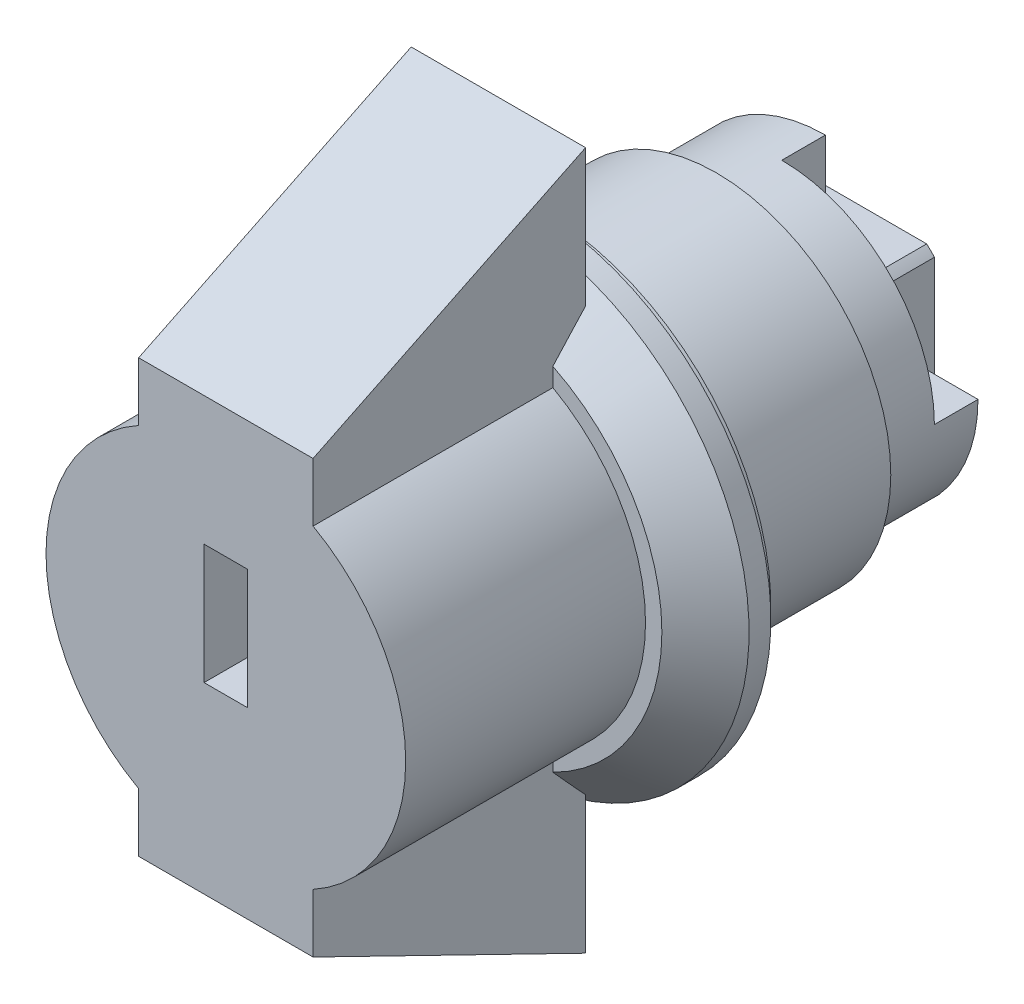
ISO-10303-21;
HEADER;
FILE_DESCRIPTION(('STEP AP214'),'2;1');
FILE_NAME('part.step','',(''),(''),'','','');
FILE_SCHEMA(('AUTOMOTIVE_DESIGN { 1 0 10303 214 1 1 1 1 }'));
ENDSEC;
DATA;
#1=APPLICATION_CONTEXT('core data for automotive mechanical design processes');
#2=APPLICATION_PROTOCOL_DEFINITION('international standard','automotive_design',2000,#1);
#3=PRODUCT_CONTEXT('',#1,'mechanical');
#4=PRODUCT('Part','Part','',(#3));
#5=PRODUCT_RELATED_PRODUCT_CATEGORY('part','',(#4));
#6=PRODUCT_DEFINITION_FORMATION('','',#4);
#7=PRODUCT_DEFINITION_CONTEXT('part definition',#1,'design');
#8=PRODUCT_DEFINITION('design','',#6,#7);
#9=PRODUCT_DEFINITION_SHAPE('','',#8);
#10=(LENGTH_UNIT() NAMED_UNIT(*) SI_UNIT(.MILLI.,.METRE.));
#11=(NAMED_UNIT(*) PLANE_ANGLE_UNIT() SI_UNIT($,.RADIAN.));
#12=(NAMED_UNIT(*) SI_UNIT($,.STERADIAN.) SOLID_ANGLE_UNIT());
#13=UNCERTAINTY_MEASURE_WITH_UNIT(LENGTH_MEASURE(1.E-05),#10,'distance_accuracy_value','');
#14=(GEOMETRIC_REPRESENTATION_CONTEXT(3) GLOBAL_UNCERTAINTY_ASSIGNED_CONTEXT((#13)) GLOBAL_UNIT_ASSIGNED_CONTEXT((#10,
#11,#12)) REPRESENTATION_CONTEXT('',''));
#15=CARTESIAN_POINT('',(0.,0.,0.));
#16=DIRECTION('',(0.,0.,1.));
#17=DIRECTION('',(1.,0.,0.));
#18=AXIS2_PLACEMENT_3D('',#15,#16,#17);
#19=CARTESIAN_POINT('',(0.,9.,3.5));
#20=DIRECTION('',(0.,0.,1.));
#21=DIRECTION('',(1.,0.,0.));
#22=AXIS2_PLACEMENT_3D('',#19,#20,#21);
#23=PLANE('',#22);
#24=CARTESIAN_POINT('',(0.,0.,3.5));
#25=DIRECTION('',(0.,0.,-1.));
#26=DIRECTION('',(-1.,0.,0.));
#27=AXIS2_PLACEMENT_3D('',#24,#25,#26);
#28=CIRCLE('',#27,9.);
#29=CARTESIAN_POINT('',(-4.,-8.06225774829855,3.5));
#30=VERTEX_POINT('',#29);
#31=CARTESIAN_POINT('',(-4.,8.06225774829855,3.5));
#32=VERTEX_POINT('',#31);
#33=EDGE_CURVE('E426',#30,#32,#28,.T.);
#34=ORIENTED_EDGE('',*,*,#33,.F.);
#35=DIRECTION('',(0.,1.,0.));
#36=VECTOR('',#35,1.);
#37=CARTESIAN_POINT('',(-4.,9.,3.5));
#38=LINE('',#37,#36);
#39=CARTESIAN_POINT('',(-4.,-7.21543484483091,3.5));
#40=VERTEX_POINT('',#39);
#41=EDGE_CURVE('E321',#30,#40,#38,.T.);
#42=ORIENTED_EDGE('',*,*,#41,.T.);
#43=CARTESIAN_POINT('',(0.,0.,3.5));
#44=DIRECTION('',(0.,0.,1.));
#45=DIRECTION('',(1.,0.,0.));
#46=AXIS2_PLACEMENT_3D('',#43,#44,#45);
#47=CIRCLE('',#46,8.25);
#48=CARTESIAN_POINT('',(-4.,7.21543484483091,3.5));
#49=VERTEX_POINT('',#48);
#50=EDGE_CURVE('E341',#49,#40,#47,.T.);
#51=ORIENTED_EDGE('',*,*,#50,.F.);
#52=EDGE_CURVE('E317',#49,#32,#38,.T.);
#53=ORIENTED_EDGE('',*,*,#52,.T.);
#54=EDGE_LOOP('',(#34,#42,#51,#53));
#55=FACE_BOUND('',#54,.T.);
#56=ADVANCED_FACE('F14',(#55),#23,.T.);
#57=CARTESIAN_POINT('',(0.,0.,1.5));
#58=DIRECTION('',(0.,0.,-1.));
#59=DIRECTION('',(-1.,0.,0.));
#60=AXIS2_PLACEMENT_3D('',#57,#58,#59);
#61=CONICAL_SURFACE('',#60,11.,0.785398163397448);
#62=CARTESIAN_POINT('',(0.,0.,1.5));
#63=DIRECTION('',(0.,0.,-1.));
#64=DIRECTION('',(-1.,0.,0.));
#65=AXIS2_PLACEMENT_3D('',#62,#63,#64);
#66=CIRCLE('',#65,11.);
#67=CARTESIAN_POINT('',(-11.,0.,1.5));
#68=VERTEX_POINT('',#67);
#69=EDGE_CURVE('E423',#68,#68,#66,.T.);
#70=ORIENTED_EDGE('',*,*,#69,.F.);
#71=EDGE_LOOP('',(#70));
#72=FACE_BOUND('',#71,.T.);
#73=CARTESIAN_POINT('',(0.,0.,2.));
#74=DIRECTION('',(0.,0.,1.));
#75=DIRECTION('',(1.,0.,0.));
#76=AXIS2_PLACEMENT_3D('',#73,#74,#75);
#77=CIRCLE('',#76,10.5);
#78=CARTESIAN_POINT('',(4.,-9.70824391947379,2.));
#79=VERTEX_POINT('',#78);
#80=CARTESIAN_POINT('',(-4.,-9.70824391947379,2.));
#81=VERTEX_POINT('',#80);
#82=EDGE_CURVE('E9',#79,#81,#77,.F.);
#83=ORIENTED_EDGE('',*,*,#82,.T.);
#84=CARTESIAN_POINT('',(-4.,-17.858105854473,-5.80059957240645));
#85=CARTESIAN_POINT('',(-4.,-17.5045819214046,-5.45563303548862));
#86=CARTESIAN_POINT('',(-4.,-17.1508222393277,-5.11090767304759));
#87=CARTESIAN_POINT('',(-4.,-16.4427152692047,-4.42205863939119));
#88=CARTESIAN_POINT('',(-4.,-16.0883679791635,-4.07793497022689));
#89=CARTESIAN_POINT('',(-4.,-15.3789386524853,-3.39037860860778));
#90=CARTESIAN_POINT('',(-4.,-15.0238565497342,-3.04694598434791));
#91=CARTESIAN_POINT('',(-4.,-14.3128340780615,-2.36097102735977));
#92=CARTESIAN_POINT('',(-4.,-13.9568937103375,-2.01842869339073));
#93=CARTESIAN_POINT('',(-4.,-13.2441762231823,-1.33467000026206));
#94=CARTESIAN_POINT('',(-4.,-12.8873997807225,-0.993452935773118));
#95=CARTESIAN_POINT('',(-4.,-12.1725099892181,-0.312422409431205));
#96=CARTESIAN_POINT('',(-4.,-11.8143966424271,0.0273910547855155));
#97=CARTESIAN_POINT('',(-4.,-11.0964623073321,0.705193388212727));
#98=CARTESIAN_POINT('',(-4.,-10.7366413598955,1.04318230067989));
#99=CARTESIAN_POINT('',(-4.,-10.0147552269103,1.71675339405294));
#100=CARTESIAN_POINT('',(-4.,-9.65269005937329,2.05233559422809));
#101=CARTESIAN_POINT('',(-4.,-9.01353072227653,2.63937643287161));
#102=CARTESIAN_POINT('',(-4.,-8.73708131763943,2.89153667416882));
#103=CARTESIAN_POINT('',(-4.,-8.18196173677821,3.393388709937));
#104=CARTESIAN_POINT('',(-4.,-7.90329163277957,3.64308058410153));
#105=CARTESIAN_POINT('',(-4.,-7.48306908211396,4.01518340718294));
#106=CARTESIAN_POINT('',(-4.,-7.34260789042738,4.13882693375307));
#107=CARTESIAN_POINT('',(-4.,-7.06084268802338,4.38514840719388));
#108=CARTESIAN_POINT('',(-4.,-6.91953868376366,4.50782636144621));
#109=CARTESIAN_POINT('',(-4.,-6.63594093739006,4.75206475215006));
#110=CARTESIAN_POINT('',(-4.,-6.49364709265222,4.87362506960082));
#111=CARTESIAN_POINT('',(-4.,-6.20790981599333,5.11539401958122));
#112=CARTESIAN_POINT('',(-4.,-6.06446635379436,5.23560261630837));
#113=CARTESIAN_POINT('',(-4.,-5.92036455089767,5.3550215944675));
#114=B_SPLINE_CURVE_WITH_KNOTS('',3,(#84,#85,#86,#87,#88,#89,#90,#91,#92,#93,#94,#95,#96,#97,
#98,#99,#100,#101,#102,#103,#104,#105,#106,#107,#108,#109,#110,#111,#112,#113),.UNSPECIFIED.,
.F.,.F.,(4,2,2,2,2,2,2,2,2,2,2,2,2,2,4),(0.,1.48183356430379,2.96367217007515,4.4456504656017,
5.92762669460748,7.4086594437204,8.88968969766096,10.3706846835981,11.8516677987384,
12.9741912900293,14.096678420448,14.65806033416,15.2194379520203,15.7808746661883,
16.342326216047),.UNSPECIFIED.);
#115=EDGE_CURVE('E330',#81,#30,#114,.T.);
#116=ORIENTED_EDGE('',*,*,#115,.T.);
#117=ORIENTED_EDGE('',*,*,#33,.T.);
#118=CARTESIAN_POINT('',(-4.,4.95832906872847,6.12936210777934));
#119=CARTESIAN_POINT('',(-4.,5.0787522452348,6.03562448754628));
#120=CARTESIAN_POINT('',(-4.,5.19853087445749,5.94106574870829));
#121=CARTESIAN_POINT('',(-4.,5.4369516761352,5.75053505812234));
#122=CARTESIAN_POINT('',(-4.,5.55559389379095,5.65456316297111));
#123=CARTESIAN_POINT('',(-4.,5.91001886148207,5.36489288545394));
#124=CARTESIAN_POINT('',(-4.,6.1443409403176,5.16940774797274));
#125=CARTESIAN_POINT('',(-4.,6.60990240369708,4.77500447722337));
#126=CARTESIAN_POINT('',(-4.,6.84114299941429,4.57608776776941));
#127=CARTESIAN_POINT('',(-4.,7.30130144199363,4.17556663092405));
#128=CARTESIAN_POINT('',(-4.,7.53021917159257,3.97396206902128));
#129=CARTESIAN_POINT('',(-4.,8.07664549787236,3.48829360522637));
#130=CARTESIAN_POINT('',(-4.,8.39327574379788,3.20324257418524));
#131=CARTESIAN_POINT('',(-4.,9.02386780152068,2.63020089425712));
#132=CARTESIAN_POINT('',(-4.,9.33782956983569,2.34221019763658));
#133=CARTESIAN_POINT('',(-4.,9.96372975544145,1.76400621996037));
#134=CARTESIAN_POINT('',(-4.,10.2756680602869,1.47379281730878));
#135=CARTESIAN_POINT('',(-4.,10.8979564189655,0.891667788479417));
#136=CARTESIAN_POINT('',(-4.,11.2083064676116,0.599756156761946));
#137=CARTESIAN_POINT('',(-4.,11.8281093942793,0.014254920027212));
#138=CARTESIAN_POINT('',(-4.,12.137560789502,-0.27933625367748));
#139=CARTESIAN_POINT('',(-4.,12.7554449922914,-0.867589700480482));
#140=CARTESIAN_POINT('',(-4.,13.0638777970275,-1.16225197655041));
#141=CARTESIAN_POINT('',(-4.,13.6798518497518,-1.75238711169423));
#142=CARTESIAN_POINT('',(-4.,13.9873932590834,-2.04785980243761));
#143=CARTESIAN_POINT('',(-4.,14.6017794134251,-2.63952462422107));
#144=CARTESIAN_POINT('',(-4.,14.9086241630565,-2.93571675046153));
#145=CARTESIAN_POINT('',(-4.,15.2151900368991,-3.23219653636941));
#146=B_SPLINE_CURVE_WITH_KNOTS('',3,(#118,#119,#120,#121,#122,#123,#124,#125,#126,#127,#128,
#129,#130,#131,#132,#133,#134,#135,#136,#137,#138,#139,#140,#141,#142,#143,#144,#145),
.UNSPECIFIED.,.F.,.F.,(4,2,2,2,2,2,2,2,2,2,2,2,2,4),(0.,0.457806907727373,0.915595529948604,
1.83101644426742,2.74606625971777,3.66116204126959,4.93925035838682,6.21735946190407,
7.49553899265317,8.77372269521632,10.0534083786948,11.3330976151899,12.6125386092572,
13.8919710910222),.UNSPECIFIED.);
#147=CARTESIAN_POINT('',(-4.,9.70824391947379,2.));
#148=VERTEX_POINT('',#147);
#149=EDGE_CURVE('E320',#32,#148,#146,.T.);
#150=ORIENTED_EDGE('',*,*,#149,.T.);
#151=CARTESIAN_POINT('',(4.,9.70824391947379,2.));
#152=VERTEX_POINT('',#151);
#153=EDGE_CURVE('E18',#148,#152,#77,.F.);
#154=ORIENTED_EDGE('',*,*,#153,.T.);
#155=CARTESIAN_POINT('',(4.,4.95832906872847,6.12936210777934));
#156=CARTESIAN_POINT('',(4.,5.0787522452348,6.03562448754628));
#157=CARTESIAN_POINT('',(4.,5.19853087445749,5.94106574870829));
#158=CARTESIAN_POINT('',(4.,5.4369516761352,5.75053505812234));
#159=CARTESIAN_POINT('',(4.,5.55559389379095,5.65456316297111));
#160=CARTESIAN_POINT('',(4.,5.91001886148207,5.36489288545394));
#161=CARTESIAN_POINT('',(4.,6.1443409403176,5.16940774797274));
#162=CARTESIAN_POINT('',(4.,6.60990240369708,4.77500447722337));
#163=CARTESIAN_POINT('',(4.,6.84114299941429,4.57608776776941));
#164=CARTESIAN_POINT('',(4.,7.30130144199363,4.17556663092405));
#165=CARTESIAN_POINT('',(4.,7.53021917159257,3.97396206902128));
#166=CARTESIAN_POINT('',(4.,8.07664549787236,3.48829360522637));
#167=CARTESIAN_POINT('',(4.,8.39327574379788,3.20324257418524));
#168=CARTESIAN_POINT('',(4.,9.02386780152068,2.63020089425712));
#169=CARTESIAN_POINT('',(4.,9.33782956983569,2.34221019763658));
#170=CARTESIAN_POINT('',(4.,9.96372975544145,1.76400621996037));
#171=CARTESIAN_POINT('',(4.,10.2756680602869,1.47379281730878));
#172=CARTESIAN_POINT('',(4.,10.8979564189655,0.891667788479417));
#173=CARTESIAN_POINT('',(4.,11.2083064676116,0.599756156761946));
#174=CARTESIAN_POINT('',(4.,11.8281093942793,0.014254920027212));
#175=CARTESIAN_POINT('',(4.,12.137560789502,-0.27933625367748));
#176=CARTESIAN_POINT('',(4.,12.7554449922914,-0.867589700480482));
#177=CARTESIAN_POINT('',(4.,13.0638777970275,-1.16225197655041));
#178=CARTESIAN_POINT('',(4.,13.6798518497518,-1.75238711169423));
#179=CARTESIAN_POINT('',(4.,13.9873932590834,-2.04785980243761));
#180=CARTESIAN_POINT('',(4.,14.6017794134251,-2.63952462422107));
#181=CARTESIAN_POINT('',(4.,14.9086241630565,-2.93571675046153));
#182=CARTESIAN_POINT('',(4.,15.2151900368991,-3.23219653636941));
#183=B_SPLINE_CURVE_WITH_KNOTS('',3,(#155,#156,#157,#158,#159,#160,#161,#162,#163,#164,#165,
#166,#167,#168,#169,#170,#171,#172,#173,#174,#175,#176,#177,#178,#179,#180,#181,#182),
.UNSPECIFIED.,.F.,.F.,(4,2,2,2,2,2,2,2,2,2,2,2,2,4),(0.,0.457806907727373,0.915595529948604,
1.83101644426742,2.74606625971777,3.66116204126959,4.93925035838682,6.21735946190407,
7.49553899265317,8.77372269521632,10.0534083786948,11.3330976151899,12.6125386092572,
13.8919710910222),.UNSPECIFIED.);
#184=CARTESIAN_POINT('',(4.,8.06225774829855,3.5));
#185=VERTEX_POINT('',#184);
#186=EDGE_CURVE('E281',#185,#152,#183,.T.);
#187=ORIENTED_EDGE('',*,*,#186,.F.);
#188=CARTESIAN_POINT('',(4.,-8.06225774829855,3.5));
#189=VERTEX_POINT('',#188);
#190=EDGE_CURVE('E429',#185,#189,#28,.T.);
#191=ORIENTED_EDGE('',*,*,#190,.T.);
#192=CARTESIAN_POINT('',(4.,-17.858105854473,-5.80059957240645));
#193=CARTESIAN_POINT('',(4.,-17.5045819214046,-5.45563303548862));
#194=CARTESIAN_POINT('',(4.,-17.1508222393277,-5.11090767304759));
#195=CARTESIAN_POINT('',(4.,-16.4427152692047,-4.42205863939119));
#196=CARTESIAN_POINT('',(4.,-16.0883679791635,-4.07793497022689));
#197=CARTESIAN_POINT('',(4.,-15.3789386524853,-3.39037860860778));
#198=CARTESIAN_POINT('',(4.,-15.0238565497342,-3.04694598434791));
#199=CARTESIAN_POINT('',(4.,-14.3128340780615,-2.36097102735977));
#200=CARTESIAN_POINT('',(4.,-13.9568937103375,-2.01842869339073));
#201=CARTESIAN_POINT('',(4.,-13.2441762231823,-1.33467000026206));
#202=CARTESIAN_POINT('',(4.,-12.8873997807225,-0.993452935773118));
#203=CARTESIAN_POINT('',(4.,-12.1725099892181,-0.312422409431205));
#204=CARTESIAN_POINT('',(4.,-11.8143966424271,0.0273910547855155));
#205=CARTESIAN_POINT('',(4.,-11.0964623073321,0.705193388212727));
#206=CARTESIAN_POINT('',(4.,-10.7366413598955,1.04318230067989));
#207=CARTESIAN_POINT('',(4.,-10.0147552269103,1.71675339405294));
#208=CARTESIAN_POINT('',(4.,-9.65269005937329,2.05233559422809));
#209=CARTESIAN_POINT('',(4.,-9.01353072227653,2.63937643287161));
#210=CARTESIAN_POINT('',(4.,-8.73708131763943,2.89153667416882));
#211=CARTESIAN_POINT('',(4.,-8.18196173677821,3.393388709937));
#212=CARTESIAN_POINT('',(4.,-7.90329163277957,3.64308058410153));
#213=CARTESIAN_POINT('',(4.,-7.48306908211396,4.01518340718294));
#214=CARTESIAN_POINT('',(4.,-7.34260789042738,4.13882693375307));
#215=CARTESIAN_POINT('',(4.,-7.06084268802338,4.38514840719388));
#216=CARTESIAN_POINT('',(4.,-6.91953868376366,4.50782636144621));
#217=CARTESIAN_POINT('',(4.,-6.63594093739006,4.75206475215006));
#218=CARTESIAN_POINT('',(4.,-6.49364709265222,4.87362506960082));
#219=CARTESIAN_POINT('',(4.,-6.20790981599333,5.11539401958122));
#220=CARTESIAN_POINT('',(4.,-6.06446635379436,5.23560261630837));
#221=CARTESIAN_POINT('',(4.,-5.92036455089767,5.3550215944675));
#222=B_SPLINE_CURVE_WITH_KNOTS('',3,(#192,#193,#194,#195,#196,#197,#198,#199,#200,#201,#202,
#203,#204,#205,#206,#207,#208,#209,#210,#211,#212,#213,#214,#215,#216,#217,#218,#219,#220,#221),
.UNSPECIFIED.,.F.,.F.,(4,2,2,2,2,2,2,2,2,2,2,2,2,2,4),(0.,1.48183356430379,2.96367217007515,
4.4456504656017,5.92762669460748,7.4086594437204,8.88968969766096,10.3706846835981,
11.8516677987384,12.9741912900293,14.096678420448,14.65806033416,15.2194379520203,
15.7808746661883,16.342326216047),.UNSPECIFIED.);
#223=EDGE_CURVE('E309',#79,#189,#222,.T.);
#224=ORIENTED_EDGE('',*,*,#223,.F.);
#225=EDGE_LOOP('',(#83,#116,#117,#150,#154,#187,#191,#224));
#226=FACE_BOUND('',#225,.T.);
#227=ADVANCED_FACE('F291',(#72,#226),#61,.T.);
#228=CARTESIAN_POINT('',(0.,0.,14.5));
#229=DIRECTION('',(0.,0.,-1.));
#230=DIRECTION('',(-1.,0.,0.));
#231=AXIS2_PLACEMENT_3D('',#228,#229,#230);
#232=CYLINDRICAL_SURFACE('',#231,8.25);
#233=DIRECTION('',(0.,0.,-1.));
#234=VECTOR('',#233,1.);
#235=CARTESIAN_POINT('',(-4.,-7.21543484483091,14.5));
#236=LINE('',#235,#234);
#237=CARTESIAN_POINT('',(-4.,-7.21543484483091,14.5));
#238=VERTEX_POINT('',#237);
#239=EDGE_CURVE('E328',#238,#40,#236,.T.);
#240=ORIENTED_EDGE('',*,*,#239,.F.);
#241=CARTESIAN_POINT('',(0.,0.,14.5));
#242=DIRECTION('',(0.,0.,1.));
#243=DIRECTION('',(1.,0.,0.));
#244=AXIS2_PLACEMENT_3D('',#241,#242,#243);
#245=CIRCLE('',#244,8.25);
#246=CARTESIAN_POINT('',(-4.,7.21543484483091,14.5));
#247=VERTEX_POINT('',#246);
#248=EDGE_CURVE('E345',#247,#238,#245,.T.);
#249=ORIENTED_EDGE('',*,*,#248,.F.);
#250=DIRECTION('',(0.,0.,-1.));
#251=VECTOR('',#250,1.);
#252=CARTESIAN_POINT('',(-4.,7.21543484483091,14.5));
#253=LINE('',#252,#251);
#254=EDGE_CURVE('E315',#49,#247,#253,.F.);
#255=ORIENTED_EDGE('',*,*,#254,.F.);
#256=ORIENTED_EDGE('',*,*,#50,.T.);
#257=EDGE_LOOP('',(#240,#249,#255,#256));
#258=FACE_BOUND('',#257,.T.);
#259=ADVANCED_FACE('F487',(#258),#232,.T.);
#260=CARTESIAN_POINT('',(0.,0.,-50.));
#261=DIRECTION('',(0.,0.,-1.));
#262=DIRECTION('',(-1.,0.,0.));
#263=AXIS2_PLACEMENT_3D('',#260,#261,#262);
#264=CYLINDRICAL_SURFACE('',#263,4.);
#265=DIRECTION('',(0.,0.,-1.));
#266=VECTOR('',#265,1.);
#267=CARTESIAN_POINT('',(-2.64575131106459,-3.,-7.61483519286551));
#268=LINE('',#267,#266);
#269=CARTESIAN_POINT('',(-2.64575131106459,-3.,-13.));
#270=VERTEX_POINT('',#269);
#271=CARTESIAN_POINT('',(-2.64575131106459,-3.,-15.));
#272=VERTEX_POINT('',#271);
#273=EDGE_CURVE('E380',#270,#272,#268,.T.);
#274=ORIENTED_EDGE('',*,*,#273,.F.);
#275=CARTESIAN_POINT('',(0.,0.,-13.));
#276=DIRECTION('',(0.,0.,-1.));
#277=DIRECTION('',(-1.,0.,0.));
#278=AXIS2_PLACEMENT_3D('',#275,#276,#277);
#279=CIRCLE('',#278,4.);
#280=CARTESIAN_POINT('',(-3.,-2.6457513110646,-13.));
#281=VERTEX_POINT('',#280);
#282=EDGE_CURVE('E440',#270,#281,#279,.T.);
#283=ORIENTED_EDGE('',*,*,#282,.T.);
#284=DIRECTION('',(0.,0.,-1.));
#285=VECTOR('',#284,1.);
#286=CARTESIAN_POINT('',(-3.,-2.6457513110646,-7.61483519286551));
#287=LINE('',#286,#285);
#288=CARTESIAN_POINT('',(-3.,-2.6457513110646,-15.));
#289=VERTEX_POINT('',#288);
#290=EDGE_CURVE('E405',#281,#289,#287,.T.);
#291=ORIENTED_EDGE('',*,*,#290,.T.);
#292=CARTESIAN_POINT('',(0.,0.,-15.));
#293=DIRECTION('',(0.,0.,-1.));
#294=DIRECTION('',(-1.,0.,0.));
#295=AXIS2_PLACEMENT_3D('',#292,#293,#294);
#296=CIRCLE('',#295,4.);
#297=EDGE_CURVE('E434',#272,#289,#296,.T.);
#298=ORIENTED_EDGE('',*,*,#297,.F.);
#299=EDGE_LOOP('',(#274,#283,#291,#298));
#300=FACE_BOUND('',#299,.T.);
#301=ADVANCED_FACE('F500',(#300),#264,.T.);
#302=DIRECTION('',(0.,0.,-1.));
#303=VECTOR('',#302,1.);
#304=CARTESIAN_POINT('',(2.64575131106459,-3.,-7.61483519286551));
#305=LINE('',#304,#303);
#306=CARTESIAN_POINT('',(2.64575131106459,-3.,-13.));
#307=VERTEX_POINT('',#306);
#308=CARTESIAN_POINT('',(2.64575131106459,-3.,-15.));
#309=VERTEX_POINT('',#308);
#310=EDGE_CURVE('E385',#307,#309,#305,.T.);
#311=ORIENTED_EDGE('',*,*,#310,.T.);
#312=CARTESIAN_POINT('',(3.,-2.64575131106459,-15.));
#313=VERTEX_POINT('',#312);
#314=EDGE_CURVE('E430',#313,#309,#296,.T.);
#315=ORIENTED_EDGE('',*,*,#314,.F.);
#316=DIRECTION('',(0.,0.,-1.));
#317=VECTOR('',#316,1.);
#318=CARTESIAN_POINT('',(3.,-2.64575131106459,-7.61483519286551));
#319=LINE('',#318,#317);
#320=CARTESIAN_POINT('',(3.,-2.64575131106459,-13.));
#321=VERTEX_POINT('',#320);
#322=EDGE_CURVE('E410',#321,#313,#319,.T.);
#323=ORIENTED_EDGE('',*,*,#322,.F.);
#324=EDGE_CURVE('E436',#321,#307,#279,.T.);
#325=ORIENTED_EDGE('',*,*,#324,.T.);
#326=EDGE_LOOP('',(#311,#315,#323,#325));
#327=FACE_BOUND('',#326,.T.);
#328=ADVANCED_FACE('F495',(#327),#264,.T.);
#329=CARTESIAN_POINT('',(0.,4.,-15.));
#330=DIRECTION('',(0.,0.,1.));
#331=DIRECTION('',(1.,0.,0.));
#332=AXIS2_PLACEMENT_3D('',#329,#330,#331);
#333=PLANE('',#332);
#334=CARTESIAN_POINT('',(0.,0.,-15.));
#335=DIRECTION('',(0.,0.,-1.));
#336=DIRECTION('',(-1.,0.,0.));
#337=AXIS2_PLACEMENT_3D('',#334,#335,#336);
#338=CIRCLE('',#337,2.5);
#339=CARTESIAN_POINT('',(-2.5,0.,-15.));
#340=VERTEX_POINT('',#339);
#341=EDGE_CURVE('E374',#340,#340,#338,.T.);
#342=ORIENTED_EDGE('',*,*,#341,.F.);
#343=EDGE_LOOP('',(#342));
#344=FACE_BOUND('',#343,.T.);
#345=DIRECTION('',(-1.,0.,0.));
#346=VECTOR('',#345,1.);
#347=CARTESIAN_POINT('',(2.64575131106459,-3.,-15.));
#348=LINE('',#347,#346);
#349=EDGE_CURVE('E381',#309,#272,#348,.T.);
#350=ORIENTED_EDGE('',*,*,#349,.T.);
#351=ORIENTED_EDGE('',*,*,#297,.T.);
#352=DIRECTION('',(0.,-1.,0.));
#353=VECTOR('',#352,1.);
#354=CARTESIAN_POINT('',(-3.,2.64575131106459,-15.));
#355=LINE('',#354,#353);
#356=CARTESIAN_POINT('',(-3.,2.64575131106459,-15.));
#357=VERTEX_POINT('',#356);
#358=EDGE_CURVE('E399',#357,#289,#355,.T.);
#359=ORIENTED_EDGE('',*,*,#358,.F.);
#360=CARTESIAN_POINT('',(-2.64575131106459,3.,-15.));
#361=VERTEX_POINT('',#360);
#362=EDGE_CURVE('E435',#357,#361,#296,.T.);
#363=ORIENTED_EDGE('',*,*,#362,.T.);
#364=DIRECTION('',(-1.,0.,0.));
#365=VECTOR('',#364,1.);
#366=CARTESIAN_POINT('',(2.64575131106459,3.,-15.));
#367=LINE('',#366,#365);
#368=CARTESIAN_POINT('',(2.64575131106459,3.,-15.));
#369=VERTEX_POINT('',#368);
#370=EDGE_CURVE('E387',#369,#361,#367,.T.);
#371=ORIENTED_EDGE('',*,*,#370,.F.);
#372=CARTESIAN_POINT('',(3.,2.64575131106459,-15.));
#373=VERTEX_POINT('',#372);
#374=EDGE_CURVE('E853',#369,#373,#296,.T.);
#375=ORIENTED_EDGE('',*,*,#374,.T.);
#376=DIRECTION('',(0.,-1.,0.));
#377=VECTOR('',#376,1.);
#378=CARTESIAN_POINT('',(3.,2.64575131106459,-15.));
#379=LINE('',#378,#377);
#380=EDGE_CURVE('E411',#373,#313,#379,.T.);
#381=ORIENTED_EDGE('',*,*,#380,.T.);
#382=ORIENTED_EDGE('',*,*,#314,.T.);
#383=EDGE_LOOP('',(#350,#351,#359,#363,#371,#375,#381,#382));
#384=FACE_BOUND('',#383,.T.);
#385=ADVANCED_FACE('F491',(#344,#384),#333,.F.);
#386=CARTESIAN_POINT('',(-3.,2.64575131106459,-13.));
#387=VERTEX_POINT('',#386);
#388=CARTESIAN_POINT('',(-2.64575131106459,3.,-13.));
#389=VERTEX_POINT('',#388);
#390=EDGE_CURVE('E433',#387,#389,#279,.T.);
#391=ORIENTED_EDGE('',*,*,#390,.T.);
#392=DIRECTION('',(0.,0.,-1.));
#393=VECTOR('',#392,1.);
#394=CARTESIAN_POINT('',(-2.64575131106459,3.,-7.61483519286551));
#395=LINE('',#394,#393);
#396=EDGE_CURVE('E394',#389,#361,#395,.T.);
#397=ORIENTED_EDGE('',*,*,#396,.T.);
#398=ORIENTED_EDGE('',*,*,#362,.F.);
#399=DIRECTION('',(0.,0.,-1.));
#400=VECTOR('',#399,1.);
#401=CARTESIAN_POINT('',(-3.,2.64575131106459,-7.61483519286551));
#402=LINE('',#401,#400);
#403=EDGE_CURVE('E408',#387,#357,#402,.T.);
#404=ORIENTED_EDGE('',*,*,#403,.F.);
#405=EDGE_LOOP('',(#391,#397,#398,#404));
#406=FACE_BOUND('',#405,.T.);
#407=ADVANCED_FACE('F494',(#406),#264,.T.);
#408=ORIENTED_EDGE('',*,*,#374,.F.);
#409=DIRECTION('',(0.,0.,-1.));
#410=VECTOR('',#409,1.);
#411=CARTESIAN_POINT('',(2.64575131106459,3.,-7.61483519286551));
#412=LINE('',#411,#410);
#413=CARTESIAN_POINT('',(2.64575131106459,3.,-13.));
#414=VERTEX_POINT('',#413);
#415=EDGE_CURVE('E397',#414,#369,#412,.T.);
#416=ORIENTED_EDGE('',*,*,#415,.F.);
#417=CARTESIAN_POINT('',(0.,0.,-13.));
#418=DIRECTION('',(0.,0.,-1.));
#419=DIRECTION('',(-1.,0.,0.));
#420=AXIS2_PLACEMENT_3D('',#417,#418,#419);
#421=CIRCLE('',#420,4.);
#422=CARTESIAN_POINT('',(0.,4.,-13.));
#423=VERTEX_POINT('',#422);
#424=EDGE_CURVE('E350',#423,#414,#421,.T.);
#425=ORIENTED_EDGE('',*,*,#424,.F.);
#426=DIRECTION('',(0.,0.,-1.));
#427=VECTOR('',#426,1.);
#428=CARTESIAN_POINT('',(0.,4.,-11.));
#429=LINE('',#428,#427);
#430=CARTESIAN_POINT('',(0.,4.,-11.));
#431=VERTEX_POINT('',#430);
#432=EDGE_CURVE('E369',#431,#423,#429,.T.);
#433=ORIENTED_EDGE('',*,*,#432,.F.);
#434=CARTESIAN_POINT('',(0.,0.,-11.));
#435=DIRECTION('',(0.,0.,-1.));
#436=DIRECTION('',(-1.,0.,0.));
#437=AXIS2_PLACEMENT_3D('',#434,#435,#436);
#438=CIRCLE('',#437,4.);
#439=CARTESIAN_POINT('',(4.,0.,-11.));
#440=VERTEX_POINT('',#439);
#441=EDGE_CURVE('E359',#431,#440,#438,.T.);
#442=ORIENTED_EDGE('',*,*,#441,.T.);
#443=DIRECTION('',(0.,0.,-1.));
#444=VECTOR('',#443,1.);
#445=CARTESIAN_POINT('',(4.,0.,-11.));
#446=LINE('',#445,#444);
#447=CARTESIAN_POINT('',(4.,0.,-13.));
#448=VERTEX_POINT('',#447);
#449=EDGE_CURVE('E367',#440,#448,#446,.T.);
#450=ORIENTED_EDGE('',*,*,#449,.T.);
#451=CARTESIAN_POINT('',(3.,2.64575131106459,-13.));
#452=VERTEX_POINT('',#451);
#453=EDGE_CURVE('E349',#452,#448,#421,.T.);
#454=ORIENTED_EDGE('',*,*,#453,.F.);
#455=DIRECTION('',(0.,0.,-1.));
#456=VECTOR('',#455,1.);
#457=CARTESIAN_POINT('',(3.,2.64575131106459,-7.61483519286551));
#458=LINE('',#457,#456);
#459=EDGE_CURVE('E415',#452,#373,#458,.T.);
#460=ORIENTED_EDGE('',*,*,#459,.T.);
#461=EDGE_LOOP('',(#408,#416,#425,#433,#442,#450,#454,#460));
#462=FACE_BOUND('',#461,.T.);
#463=ADVANCED_FACE('F462',(#462),#264,.T.);
#464=CARTESIAN_POINT('',(0.,11.,0.5));
#465=DIRECTION('',(0.,0.,1.));
#466=DIRECTION('',(1.,0.,0.));
#467=AXIS2_PLACEMENT_3D('',#464,#465,#466);
#468=PLANE('',#467);
#469=CARTESIAN_POINT('',(0.,0.,0.5));
#470=DIRECTION('',(0.,0.,-1.));
#471=DIRECTION('',(-1.,0.,0.));
#472=AXIS2_PLACEMENT_3D('',#469,#470,#471);
#473=CIRCLE('',#472,10.5);
#474=CARTESIAN_POINT('',(-10.5,0.,0.5));
#475=VERTEX_POINT('',#474);
#476=EDGE_CURVE('E342',#475,#475,#473,.T.);
#477=ORIENTED_EDGE('',*,*,#476,.F.);
#478=EDGE_LOOP('',(#477));
#479=FACE_BOUND('',#478,.T.);
#480=CARTESIAN_POINT('',(0.,0.,0.5));
#481=DIRECTION('',(0.,0.,-1.));
#482=DIRECTION('',(-1.,0.,0.));
#483=AXIS2_PLACEMENT_3D('',#480,#481,#482);
#484=CIRCLE('',#483,11.);
#485=CARTESIAN_POINT('',(-11.,0.,0.5));
#486=VERTEX_POINT('',#485);
#487=EDGE_CURVE('E417',#486,#486,#484,.T.);
#488=ORIENTED_EDGE('',*,*,#487,.T.);
#489=EDGE_LOOP('',(#488));
#490=FACE_BOUND('',#489,.T.);
#491=ADVANCED_FACE('F16',(#479,#490),#468,.F.);
#492=CARTESIAN_POINT('',(0.,0.,-50.));
#493=DIRECTION('',(0.,0.,-1.));
#494=DIRECTION('',(-1.,0.,0.));
#495=AXIS2_PLACEMENT_3D('',#492,#493,#494);
#496=CYLINDRICAL_SURFACE('',#495,10.5);
#497=ORIENTED_EDGE('',*,*,#476,.T.);
#498=EDGE_LOOP('',(#497));
#499=FACE_BOUND('',#498,.T.);
#500=CARTESIAN_POINT('',(0.,0.,0.));
#501=DIRECTION('',(0.,0.,-1.));
#502=DIRECTION('',(-1.,0.,0.));
#503=AXIS2_PLACEMENT_3D('',#500,#501,#502);
#504=CIRCLE('',#503,10.5);
#505=CARTESIAN_POINT('',(-10.5,0.,0.));
#506=VERTEX_POINT('',#505);
#507=EDGE_CURVE('E452',#506,#506,#504,.T.);
#508=ORIENTED_EDGE('',*,*,#507,.F.);
#509=EDGE_LOOP('',(#508));
#510=FACE_BOUND('',#509,.T.);
#511=ADVANCED_FACE('F457',(#499,#510),#496,.T.);
#512=CARTESIAN_POINT('',(0.,10.5,0.));
#513=DIRECTION('',(0.,0.,1.));
#514=DIRECTION('',(1.,0.,0.));
#515=AXIS2_PLACEMENT_3D('',#512,#513,#514);
#516=PLANE('',#515);
#517=CARTESIAN_POINT('',(0.,0.,0.));
#518=DIRECTION('',(0.,0.,-1.));
#519=DIRECTION('',(-1.,0.,0.));
#520=AXIS2_PLACEMENT_3D('',#517,#518,#519);
#521=CIRCLE('',#520,8.);
#522=CARTESIAN_POINT('',(-8.,0.,0.));
#523=VERTEX_POINT('',#522);
#524=EDGE_CURVE('E449',#523,#523,#521,.T.);
#525=ORIENTED_EDGE('',*,*,#524,.F.);
#526=EDGE_LOOP('',(#525));
#527=FACE_BOUND('',#526,.T.);
#528=ORIENTED_EDGE('',*,*,#507,.T.);
#529=EDGE_LOOP('',(#528));
#530=FACE_BOUND('',#529,.T.);
#531=ADVANCED_FACE('F515',(#527,#530),#516,.F.);
#532=CARTESIAN_POINT('',(0.,0.,-50.));
#533=DIRECTION('',(0.,0.,-1.));
#534=DIRECTION('',(-1.,0.,0.));
#535=AXIS2_PLACEMENT_3D('',#532,#533,#534);
#536=CYLINDRICAL_SURFACE('',#535,8.);
#537=ORIENTED_EDGE('',*,*,#524,.T.);
#538=EDGE_LOOP('',(#537));
#539=FACE_BOUND('',#538,.T.);
#540=CARTESIAN_POINT('',(0.,0.,-8.));
#541=DIRECTION('',(0.,0.,-1.));
#542=DIRECTION('',(-1.,0.,0.));
#543=AXIS2_PLACEMENT_3D('',#540,#541,#542);
#544=CIRCLE('',#543,8.);
#545=CARTESIAN_POINT('',(-8.,0.,-8.));
#546=VERTEX_POINT('',#545);
#547=EDGE_CURVE('E446',#546,#546,#544,.T.);
#548=ORIENTED_EDGE('',*,*,#547,.F.);
#549=EDGE_LOOP('',(#548));
#550=FACE_BOUND('',#549,.T.);
#551=ADVANCED_FACE('F511',(#539,#550),#536,.T.);
#552=CARTESIAN_POINT('',(0.,8.,-8.));
#553=DIRECTION('',(0.,0.,1.));
#554=DIRECTION('',(1.,0.,0.));
#555=AXIS2_PLACEMENT_3D('',#552,#553,#554);
#556=PLANE('',#555);
#557=CARTESIAN_POINT('',(0.,0.,-8.));
#558=DIRECTION('',(0.,0.,-1.));
#559=DIRECTION('',(-1.,0.,0.));
#560=AXIS2_PLACEMENT_3D('',#557,#558,#559);
#561=CIRCLE('',#560,7.);
#562=CARTESIAN_POINT('',(-7.,0.,-8.));
#563=VERTEX_POINT('',#562);
#564=EDGE_CURVE('E443',#563,#563,#561,.T.);
#565=ORIENTED_EDGE('',*,*,#564,.F.);
#566=EDGE_LOOP('',(#565));
#567=FACE_BOUND('',#566,.T.);
#568=ORIENTED_EDGE('',*,*,#547,.T.);
#569=EDGE_LOOP('',(#568));
#570=FACE_BOUND('',#569,.T.);
#571=ADVANCED_FACE('F507',(#567,#570),#556,.F.);
#572=CARTESIAN_POINT('',(0.,0.,-50.));
#573=DIRECTION('',(0.,0.,-1.));
#574=DIRECTION('',(-1.,0.,0.));
#575=AXIS2_PLACEMENT_3D('',#572,#573,#574);
#576=CYLINDRICAL_SURFACE('',#575,7.);
#577=CARTESIAN_POINT('',(0.,0.,-11.));
#578=DIRECTION('',(0.,0.,-1.));
#579=DIRECTION('',(-1.,0.,0.));
#580=AXIS2_PLACEMENT_3D('',#577,#578,#579);
#581=CIRCLE('',#580,7.);
#582=CARTESIAN_POINT('',(0.,7.,-11.));
#583=VERTEX_POINT('',#582);
#584=CARTESIAN_POINT('',(7.,0.,-11.));
#585=VERTEX_POINT('',#584);
#586=EDGE_CURVE('E354',#583,#585,#581,.T.);
#587=ORIENTED_EDGE('',*,*,#586,.F.);
#588=DIRECTION('',(0.,0.,-1.));
#589=VECTOR('',#588,1.);
#590=CARTESIAN_POINT('',(0.,7.,-11.));
#591=LINE('',#590,#589);
#592=CARTESIAN_POINT('',(0.,7.,-13.));
#593=VERTEX_POINT('',#592);
#594=EDGE_CURVE('E371',#583,#593,#591,.T.);
#595=ORIENTED_EDGE('',*,*,#594,.T.);
#596=CARTESIAN_POINT('',(0.,0.,-13.));
#597=DIRECTION('',(0.,0.,-1.));
#598=DIRECTION('',(-1.,0.,0.));
#599=AXIS2_PLACEMENT_3D('',#596,#597,#598);
#600=CIRCLE('',#599,7.);
#601=CARTESIAN_POINT('',(7.,0.,-13.));
#602=VERTEX_POINT('',#601);
#603=EDGE_CURVE('E439',#602,#593,#600,.T.);
#604=ORIENTED_EDGE('',*,*,#603,.F.);
#605=DIRECTION('',(0.,0.,-1.));
#606=VECTOR('',#605,1.);
#607=CARTESIAN_POINT('',(7.,0.,-11.));
#608=LINE('',#607,#606);
#609=EDGE_CURVE('E365',#585,#602,#608,.T.);
#610=ORIENTED_EDGE('',*,*,#609,.F.);
#611=EDGE_LOOP('',(#587,#595,#604,#610));
#612=FACE_BOUND('',#611,.T.);
#613=ORIENTED_EDGE('',*,*,#564,.T.);
#614=EDGE_LOOP('',(#613));
#615=FACE_BOUND('',#614,.T.);
#616=ADVANCED_FACE('F503',(#612,#615),#576,.T.);
#617=CARTESIAN_POINT('',(0.,7.,-13.));
#618=DIRECTION('',(0.,0.,1.));
#619=DIRECTION('',(1.,0.,0.));
#620=AXIS2_PLACEMENT_3D('',#617,#618,#619);
#621=PLANE('',#620);
#622=ORIENTED_EDGE('',*,*,#603,.T.);
#623=DIRECTION('',(0.,1.,0.));
#624=VECTOR('',#623,1.);
#625=CARTESIAN_POINT('',(0.,4.,-13.));
#626=LINE('',#625,#624);
#627=EDGE_CURVE('E352',#423,#593,#626,.T.);
#628=ORIENTED_EDGE('',*,*,#627,.F.);
#629=ORIENTED_EDGE('',*,*,#424,.T.);
#630=DIRECTION('',(-1.,0.,0.));
#631=VECTOR('',#630,1.);
#632=CARTESIAN_POINT('',(2.64575131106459,3.,-13.));
#633=LINE('',#632,#631);
#634=EDGE_CURVE('E392',#414,#389,#633,.T.);
#635=ORIENTED_EDGE('',*,*,#634,.T.);
#636=ORIENTED_EDGE('',*,*,#390,.F.);
#637=DIRECTION('',(0.,-1.,0.));
#638=VECTOR('',#637,1.);
#639=CARTESIAN_POINT('',(-3.,2.64575131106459,-13.));
#640=LINE('',#639,#638);
#641=EDGE_CURVE('E402',#387,#281,#640,.T.);
#642=ORIENTED_EDGE('',*,*,#641,.T.);
#643=ORIENTED_EDGE('',*,*,#282,.F.);
#644=DIRECTION('',(-1.,0.,0.));
#645=VECTOR('',#644,1.);
#646=CARTESIAN_POINT('',(2.64575131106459,-3.,-13.));
#647=LINE('',#646,#645);
#648=EDGE_CURVE('E384',#307,#270,#647,.T.);
#649=ORIENTED_EDGE('',*,*,#648,.F.);
#650=ORIENTED_EDGE('',*,*,#324,.F.);
#651=DIRECTION('',(0.,-1.,0.));
#652=VECTOR('',#651,1.);
#653=CARTESIAN_POINT('',(3.,2.64575131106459,-13.));
#654=LINE('',#653,#652);
#655=EDGE_CURVE('E414',#452,#321,#654,.T.);
#656=ORIENTED_EDGE('',*,*,#655,.F.);
#657=ORIENTED_EDGE('',*,*,#453,.T.);
#658=DIRECTION('',(1.,0.,0.));
#659=VECTOR('',#658,1.);
#660=CARTESIAN_POINT('',(4.,0.,-13.));
#661=LINE('',#660,#659);
#662=EDGE_CURVE('E346',#448,#602,#661,.T.);
#663=ORIENTED_EDGE('',*,*,#662,.T.);
#664=EDGE_LOOP('',(#622,#628,#629,#635,#636,#642,#643,#649,#650,#656,#657,#663));
#665=FACE_BOUND('',#664,.T.);
#666=ADVANCED_FACE('F479',(#665),#621,.F.);
#667=DIRECTION('',(0.,1.,0.));
#668=VECTOR('',#667,1.);
#669=CARTESIAN_POINT('',(4.,9.,3.5));
#670=LINE('',#669,#668);
#671=CARTESIAN_POINT('',(4.,-7.21543484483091,3.5));
#672=VERTEX_POINT('',#671);
#673=EDGE_CURVE('E37',#189,#672,#670,.T.);
#674=ORIENTED_EDGE('',*,*,#673,.F.);
#675=ORIENTED_EDGE('',*,*,#190,.F.);
#676=CARTESIAN_POINT('',(4.,7.21543484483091,3.5));
#677=VERTEX_POINT('',#676);
#678=EDGE_CURVE('E279',#677,#185,#670,.T.);
#679=ORIENTED_EDGE('',*,*,#678,.F.);
#680=EDGE_CURVE('E338',#672,#677,#47,.T.);
#681=ORIENTED_EDGE('',*,*,#680,.F.);
#682=EDGE_LOOP('',(#674,#675,#679,#681));
#683=FACE_BOUND('',#682,.T.);
#684=ADVANCED_FACE('F468',(#683),#23,.T.);
#685=CARTESIAN_POINT('',(0.,0.,-50.));
#686=DIRECTION('',(0.,0.,-1.));
#687=DIRECTION('',(-1.,0.,0.));
#688=AXIS2_PLACEMENT_3D('',#685,#686,#687);
#689=CYLINDRICAL_SURFACE('',#688,11.);
#690=ORIENTED_EDGE('',*,*,#69,.T.);
#691=EDGE_LOOP('',(#690));
#692=FACE_BOUND('',#691,.T.);
#693=ORIENTED_EDGE('',*,*,#487,.F.);
#694=EDGE_LOOP('',(#693));
#695=FACE_BOUND('',#694,.T.);
#696=ADVANCED_FACE('F465',(#692,#695),#689,.T.);
#697=CARTESIAN_POINT('',(3.,2.64575131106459,-7.61483519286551));
#698=DIRECTION('',(1.,0.,0.));
#699=DIRECTION('',(0.,1.,0.));
#700=AXIS2_PLACEMENT_3D('',#697,#698,#699);
#701=PLANE('',#700);
#702=ORIENTED_EDGE('',*,*,#655,.T.);
#703=ORIENTED_EDGE('',*,*,#322,.T.);
#704=ORIENTED_EDGE('',*,*,#380,.F.);
#705=ORIENTED_EDGE('',*,*,#459,.F.);
#706=EDGE_LOOP('',(#702,#703,#704,#705));
#707=FACE_BOUND('',#706,.T.);
#708=ADVANCED_FACE('F467',(#707),#701,.T.);
#709=CARTESIAN_POINT('',(-3.,2.64575131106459,-7.61483519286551));
#710=DIRECTION('',(1.,0.,0.));
#711=DIRECTION('',(0.,1.,0.));
#712=AXIS2_PLACEMENT_3D('',#709,#710,#711);
#713=PLANE('',#712);
#714=ORIENTED_EDGE('',*,*,#403,.T.);
#715=ORIENTED_EDGE('',*,*,#358,.T.);
#716=ORIENTED_EDGE('',*,*,#290,.F.);
#717=ORIENTED_EDGE('',*,*,#641,.F.);
#718=EDGE_LOOP('',(#714,#715,#716,#717));
#719=FACE_BOUND('',#718,.T.);
#720=ADVANCED_FACE('F476',(#719),#713,.F.);
#721=CARTESIAN_POINT('',(2.64575131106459,3.,-7.61483519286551));
#722=DIRECTION('',(0.,-1.,0.));
#723=DIRECTION('',(1.,0.,0.));
#724=AXIS2_PLACEMENT_3D('',#721,#722,#723);
#725=PLANE('',#724);
#726=ORIENTED_EDGE('',*,*,#415,.T.);
#727=ORIENTED_EDGE('',*,*,#370,.T.);
#728=ORIENTED_EDGE('',*,*,#396,.F.);
#729=ORIENTED_EDGE('',*,*,#634,.F.);
#730=EDGE_LOOP('',(#726,#727,#728,#729));
#731=FACE_BOUND('',#730,.T.);
#732=ADVANCED_FACE('F801',(#731),#725,.F.);
#733=CARTESIAN_POINT('',(2.64575131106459,-3.,-7.61483519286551));
#734=DIRECTION('',(0.,-1.,0.));
#735=DIRECTION('',(1.,0.,0.));
#736=AXIS2_PLACEMENT_3D('',#733,#734,#735);
#737=PLANE('',#736);
#738=ORIENTED_EDGE('',*,*,#648,.T.);
#739=ORIENTED_EDGE('',*,*,#273,.T.);
#740=ORIENTED_EDGE('',*,*,#349,.F.);
#741=ORIENTED_EDGE('',*,*,#310,.F.);
#742=EDGE_LOOP('',(#738,#739,#740,#741));
#743=FACE_BOUND('',#742,.T.);
#744=ADVANCED_FACE('F784',(#743),#737,.T.);
#745=CARTESIAN_POINT('',(0.,0.,-7.));
#746=DIRECTION('',(0.,0.,-1.));
#747=DIRECTION('',(-1.,0.,0.));
#748=AXIS2_PLACEMENT_3D('',#745,#746,#747);
#749=CYLINDRICAL_SURFACE('',#748,2.5);
#750=CARTESIAN_POINT('',(0.,0.,-7.));
#751=DIRECTION('',(0.,0.,-1.));
#752=DIRECTION('',(-1.,0.,0.));
#753=AXIS2_PLACEMENT_3D('',#750,#751,#752);
#754=CIRCLE('',#753,2.5);
#755=CARTESIAN_POINT('',(-2.5,0.,-7.));
#756=VERTEX_POINT('',#755);
#757=EDGE_CURVE('E377',#756,#756,#754,.T.);
#758=ORIENTED_EDGE('',*,*,#757,.F.);
#759=EDGE_LOOP('',(#758));
#760=FACE_BOUND('',#759,.T.);
#761=ORIENTED_EDGE('',*,*,#341,.T.);
#762=EDGE_LOOP('',(#761));
#763=FACE_BOUND('',#762,.T.);
#764=ADVANCED_FACE('F774',(#760,#763),#749,.F.);
#765=CARTESIAN_POINT('',(0.,0.,-7.));
#766=DIRECTION('',(0.,0.,-1.));
#767=DIRECTION('',(-1.,0.,0.));
#768=AXIS2_PLACEMENT_3D('',#765,#766,#767);
#769=PLANE('',#768);
#770=ORIENTED_EDGE('',*,*,#757,.T.);
#771=EDGE_LOOP('',(#770));
#772=FACE_BOUND('',#771,.T.);
#773=ADVANCED_FACE('F771',(#772),#769,.T.);
#774=CARTESIAN_POINT('',(0.,4.,-11.));
#775=DIRECTION('',(-1.,0.,0.));
#776=DIRECTION('',(0.,0.,1.));
#777=AXIS2_PLACEMENT_3D('',#774,#775,#776);
#778=PLANE('',#777);
#779=ORIENTED_EDGE('',*,*,#432,.T.);
#780=ORIENTED_EDGE('',*,*,#627,.T.);
#781=ORIENTED_EDGE('',*,*,#594,.F.);
#782=DIRECTION('',(0.,1.,0.));
#783=VECTOR('',#782,1.);
#784=CARTESIAN_POINT('',(0.,4.,-11.));
#785=LINE('',#784,#783);
#786=EDGE_CURVE('E362',#431,#583,#785,.T.);
#787=ORIENTED_EDGE('',*,*,#786,.F.);
#788=EDGE_LOOP('',(#779,#780,#781,#787));
#789=FACE_BOUND('',#788,.T.);
#790=ADVANCED_FACE('F754',(#789),#778,.F.);
#791=CARTESIAN_POINT('',(4.,0.,-11.));
#792=DIRECTION('',(0.,1.,0.));
#793=DIRECTION('',(-1.,0.,0.));
#794=AXIS2_PLACEMENT_3D('',#791,#792,#793);
#795=PLANE('',#794);
#796=DIRECTION('',(1.,0.,0.));
#797=VECTOR('',#796,1.);
#798=CARTESIAN_POINT('',(4.,0.,-11.));
#799=LINE('',#798,#797);
#800=EDGE_CURVE('E356',#440,#585,#799,.T.);
#801=ORIENTED_EDGE('',*,*,#800,.T.);
#802=ORIENTED_EDGE('',*,*,#609,.T.);
#803=ORIENTED_EDGE('',*,*,#662,.F.);
#804=ORIENTED_EDGE('',*,*,#449,.F.);
#805=EDGE_LOOP('',(#801,#802,#803,#804));
#806=FACE_BOUND('',#805,.T.);
#807=ADVANCED_FACE('F735',(#806),#795,.T.);
#808=CARTESIAN_POINT('',(0.,0.,-11.));
#809=DIRECTION('',(0.,0.,-1.));
#810=DIRECTION('',(-1.,0.,0.));
#811=AXIS2_PLACEMENT_3D('',#808,#809,#810);
#812=PLANE('',#811);
#813=ORIENTED_EDGE('',*,*,#586,.T.);
#814=ORIENTED_EDGE('',*,*,#800,.F.);
#815=ORIENTED_EDGE('',*,*,#441,.F.);
#816=ORIENTED_EDGE('',*,*,#786,.T.);
#817=EDGE_LOOP('',(#813,#814,#815,#816));
#818=FACE_BOUND('',#817,.T.);
#819=ADVANCED_FACE('F743',(#818),#812,.T.);
#820=CARTESIAN_POINT('',(4.,-7.21543484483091,14.5));
#821=VERTEX_POINT('',#820);
#822=CARTESIAN_POINT('',(4.,7.21543484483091,14.5));
#823=VERTEX_POINT('',#822);
#824=EDGE_CURVE('E337',#821,#823,#245,.T.);
#825=ORIENTED_EDGE('',*,*,#824,.F.);
#826=DIRECTION('',(0.,0.,-1.));
#827=VECTOR('',#826,1.);
#828=CARTESIAN_POINT('',(4.,-7.21543484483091,14.5));
#829=LINE('',#828,#827);
#830=EDGE_CURVE('E289',#821,#672,#829,.T.);
#831=ORIENTED_EDGE('',*,*,#830,.T.);
#832=ORIENTED_EDGE('',*,*,#680,.T.);
#833=DIRECTION('',(0.,0.,-1.));
#834=VECTOR('',#833,1.);
#835=CARTESIAN_POINT('',(4.,7.21543484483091,14.5));
#836=LINE('',#835,#834);
#837=EDGE_CURVE('E276',#677,#823,#836,.F.);
#838=ORIENTED_EDGE('',*,*,#837,.T.);
#839=EDGE_LOOP('',(#825,#831,#832,#838));
#840=FACE_BOUND('',#839,.T.);
#841=ADVANCED_FACE('F613',(#840),#232,.T.);
#842=CARTESIAN_POINT('',(0.,0.,14.5));
#843=DIRECTION('',(0.,0.,1.));
#844=DIRECTION('',(1.,0.,0.));
#845=AXIS2_PLACEMENT_3D('',#842,#843,#844);
#846=PLANE('',#845);
#847=DIRECTION('',(0.,-1.,0.));
#848=VECTOR('',#847,1.);
#849=CARTESIAN_POINT('',(-1.,4.,14.5));
#850=LINE('',#849,#848);
#851=CARTESIAN_POINT('',(-1.,4.,14.5));
#852=VERTEX_POINT('',#851);
#853=CARTESIAN_POINT('',(-1.,-1.5,14.5));
#854=VERTEX_POINT('',#853);
#855=EDGE_CURVE('E29',#852,#854,#850,.T.);
#856=ORIENTED_EDGE('',*,*,#855,.F.);
#857=DIRECTION('',(1.,0.,0.));
#858=VECTOR('',#857,1.);
#859=CARTESIAN_POINT('',(-1.,4.,14.5));
#860=LINE('',#859,#858);
#861=CARTESIAN_POINT('',(1.,4.,14.5));
#862=VERTEX_POINT('',#861);
#863=EDGE_CURVE('E221',#852,#862,#860,.T.);
#864=ORIENTED_EDGE('',*,*,#863,.T.);
#865=DIRECTION('',(0.,1.,0.));
#866=VECTOR('',#865,1.);
#867=CARTESIAN_POINT('',(1.,-1.5,14.5));
#868=LINE('',#867,#866);
#869=CARTESIAN_POINT('',(1.,-1.5,14.5));
#870=VERTEX_POINT('',#869);
#871=EDGE_CURVE('E203',#870,#862,#868,.T.);
#872=ORIENTED_EDGE('',*,*,#871,.F.);
#873=DIRECTION('',(-1.,0.,0.));
#874=VECTOR('',#873,1.);
#875=CARTESIAN_POINT('',(1.,-1.5,14.5));
#876=LINE('',#875,#874);
#877=EDGE_CURVE('E214',#870,#854,#876,.T.);
#878=ORIENTED_EDGE('',*,*,#877,.T.);
#879=EDGE_LOOP('',(#856,#864,#872,#878));
#880=FACE_BOUND('',#879,.T.);
#881=ORIENTED_EDGE('',*,*,#824,.T.);
#882=DIRECTION('',(0.,-1.,0.));
#883=VECTOR('',#882,1.);
#884=CARTESIAN_POINT('',(4.,9.90334264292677,14.5));
#885=LINE('',#884,#883);
#886=CARTESIAN_POINT('',(4.,9.90334264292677,14.5));
#887=VERTEX_POINT('',#886);
#888=EDGE_CURVE('E243',#887,#823,#885,.T.);
#889=ORIENTED_EDGE('',*,*,#888,.F.);
#890=DIRECTION('',(1.,0.,0.));
#891=VECTOR('',#890,1.);
#892=CARTESIAN_POINT('',(-4.,9.90334264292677,14.5));
#893=LINE('',#892,#891);
#894=CARTESIAN_POINT('',(-4.,9.90334264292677,14.5));
#895=VERTEX_POINT('',#894);
#896=EDGE_CURVE('E266',#895,#887,#893,.T.);
#897=ORIENTED_EDGE('',*,*,#896,.F.);
#898=DIRECTION('',(0.,-1.,0.));
#899=VECTOR('',#898,1.);
#900=CARTESIAN_POINT('',(-4.,9.90334264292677,14.5));
#901=LINE('',#900,#899);
#902=EDGE_CURVE('E256',#895,#247,#901,.T.);
#903=ORIENTED_EDGE('',*,*,#902,.T.);
#904=ORIENTED_EDGE('',*,*,#248,.T.);
#905=CARTESIAN_POINT('',(-4.,-9.90334264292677,14.5));
#906=VERTEX_POINT('',#905);
#907=EDGE_CURVE('E255',#238,#906,#901,.T.);
#908=ORIENTED_EDGE('',*,*,#907,.T.);
#909=DIRECTION('',(1.,0.,0.));
#910=VECTOR('',#909,1.);
#911=CARTESIAN_POINT('',(-4.,-9.90334264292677,14.5));
#912=LINE('',#911,#910);
#913=CARTESIAN_POINT('',(4.,-9.90334264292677,14.5));
#914=VERTEX_POINT('',#913);
#915=EDGE_CURVE('E268',#906,#914,#912,.T.);
#916=ORIENTED_EDGE('',*,*,#915,.T.);
#917=EDGE_CURVE('E242',#821,#914,#885,.T.);
#918=ORIENTED_EDGE('',*,*,#917,.F.);
#919=EDGE_LOOP('',(#881,#889,#897,#903,#904,#908,#916,#918));
#920=FACE_BOUND('',#919,.T.);
#921=ADVANCED_FACE('F218',(#880,#920),#846,.T.);
#922=CARTESIAN_POINT('',(-4.,16.,2.));
#923=DIRECTION('',(0.,0.898794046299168,0.438371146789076));
#924=DIRECTION('',(0.,0.438371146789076,-0.898794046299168));
#925=AXIS2_PLACEMENT_3D('',#922,#923,#924);
#926=PLANE('',#925);
#927=DIRECTION('',(1.,0.,0.));
#928=VECTOR('',#927,1.);
#929=CARTESIAN_POINT('',(-4.,16.,2.));
#930=LINE('',#929,#928);
#931=CARTESIAN_POINT('',(-4.,16.,2.));
#932=VERTEX_POINT('',#931);
#933=CARTESIAN_POINT('',(4.,16.,2.));
#934=VERTEX_POINT('',#933);
#935=EDGE_CURVE('E274',#932,#934,#930,.T.);
#936=ORIENTED_EDGE('',*,*,#935,.F.);
#937=DIRECTION('',(0.,-0.438371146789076,0.898794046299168));
#938=VECTOR('',#937,1.);
#939=CARTESIAN_POINT('',(-4.,16.,2.));
#940=LINE('',#939,#938);
#941=EDGE_CURVE('E252',#932,#895,#940,.T.);
#942=ORIENTED_EDGE('',*,*,#941,.T.);
#943=ORIENTED_EDGE('',*,*,#896,.T.);
#944=DIRECTION('',(0.,-0.438371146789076,0.898794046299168));
#945=VECTOR('',#944,1.);
#946=CARTESIAN_POINT('',(4.,16.,2.));
#947=LINE('',#946,#945);
#948=EDGE_CURVE('E239',#934,#887,#947,.T.);
#949=ORIENTED_EDGE('',*,*,#948,.F.);
#950=EDGE_LOOP('',(#936,#942,#943,#949));
#951=FACE_BOUND('',#950,.T.);
#952=ADVANCED_FACE('F717',(#951),#926,.T.);
#953=CARTESIAN_POINT('',(-4.,9.90334264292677,14.5));
#954=DIRECTION('',(1.,0.,0.));
#955=DIRECTION('',(0.,0.,-1.));
#956=AXIS2_PLACEMENT_3D('',#953,#954,#955);
#957=PLANE('',#956);
#958=ORIENTED_EDGE('',*,*,#149,.F.);
#959=ORIENTED_EDGE('',*,*,#52,.F.);
#960=ORIENTED_EDGE('',*,*,#254,.T.);
#961=ORIENTED_EDGE('',*,*,#902,.F.);
#962=ORIENTED_EDGE('',*,*,#941,.F.);
#963=DIRECTION('',(0.,-1.,0.));
#964=VECTOR('',#963,1.);
#965=CARTESIAN_POINT('',(-4.,16.,2.));
#966=LINE('',#965,#964);
#967=EDGE_CURVE('E263',#932,#148,#966,.T.);
#968=ORIENTED_EDGE('',*,*,#967,.T.);
#969=EDGE_LOOP('',(#958,#959,#960,#961,#962,#968));
#970=FACE_BOUND('',#969,.T.);
#971=ADVANCED_FACE('F301',(#970),#957,.F.);
#972=CARTESIAN_POINT('',(4.,9.90334264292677,14.5));
#973=DIRECTION('',(1.,0.,0.));
#974=DIRECTION('',(0.,0.,-1.));
#975=AXIS2_PLACEMENT_3D('',#972,#973,#974);
#976=PLANE('',#975);
#977=ORIENTED_EDGE('',*,*,#678,.T.);
#978=ORIENTED_EDGE('',*,*,#186,.T.);
#979=DIRECTION('',(0.,-1.,0.));
#980=VECTOR('',#979,1.);
#981=CARTESIAN_POINT('',(4.,16.,2.));
#982=LINE('',#981,#980);
#983=EDGE_CURVE('E249',#934,#152,#982,.T.);
#984=ORIENTED_EDGE('',*,*,#983,.F.);
#985=ORIENTED_EDGE('',*,*,#948,.T.);
#986=ORIENTED_EDGE('',*,*,#888,.T.);
#987=ORIENTED_EDGE('',*,*,#837,.F.);
#988=EDGE_LOOP('',(#977,#978,#984,#985,#986,#987));
#989=FACE_BOUND('',#988,.T.);
#990=ADVANCED_FACE('F295',(#989),#976,.T.);
#991=CARTESIAN_POINT('',(-4.,16.,2.));
#992=DIRECTION('',(0.,0.,1.));
#993=DIRECTION('',(1.,0.,0.));
#994=AXIS2_PLACEMENT_3D('',#991,#992,#993);
#995=PLANE('',#994);
#996=ORIENTED_EDGE('',*,*,#153,.F.);
#997=ORIENTED_EDGE('',*,*,#967,.F.);
#998=ORIENTED_EDGE('',*,*,#935,.T.);
#999=ORIENTED_EDGE('',*,*,#983,.T.);
#1000=EDGE_LOOP('',(#996,#997,#998,#999));
#1001=FACE_BOUND('',#1000,.T.);
#1002=ADVANCED_FACE('F300',(#1001),#995,.F.);
#1003=ORIENTED_EDGE('',*,*,#82,.F.);
#1004=CARTESIAN_POINT('',(4.,-16.,2.));
#1005=VERTEX_POINT('',#1004);
#1006=EDGE_CURVE('E248',#79,#1005,#982,.T.);
#1007=ORIENTED_EDGE('',*,*,#1006,.T.);
#1008=DIRECTION('',(1.,0.,0.));
#1009=VECTOR('',#1008,1.);
#1010=CARTESIAN_POINT('',(-4.,-16.,2.));
#1011=LINE('',#1010,#1009);
#1012=CARTESIAN_POINT('',(-4.,-16.,2.));
#1013=VERTEX_POINT('',#1012);
#1014=EDGE_CURVE('E271',#1013,#1005,#1011,.T.);
#1015=ORIENTED_EDGE('',*,*,#1014,.F.);
#1016=EDGE_CURVE('E262',#81,#1013,#966,.T.);
#1017=ORIENTED_EDGE('',*,*,#1016,.F.);
#1018=EDGE_LOOP('',(#1003,#1007,#1015,#1017));
#1019=FACE_BOUND('',#1018,.T.);
#1020=ADVANCED_FACE('F690',(#1019),#995,.F.);
#1021=ORIENTED_EDGE('',*,*,#115,.F.);
#1022=ORIENTED_EDGE('',*,*,#1016,.T.);
#1023=DIRECTION('',(0.,0.438371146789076,0.898794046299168));
#1024=VECTOR('',#1023,1.);
#1025=CARTESIAN_POINT('',(-4.,-16.,2.));
#1026=LINE('',#1025,#1024);
#1027=EDGE_CURVE('E259',#1013,#906,#1026,.T.);
#1028=ORIENTED_EDGE('',*,*,#1027,.T.);
#1029=ORIENTED_EDGE('',*,*,#907,.F.);
#1030=ORIENTED_EDGE('',*,*,#239,.T.);
#1031=ORIENTED_EDGE('',*,*,#41,.F.);
#1032=EDGE_LOOP('',(#1021,#1022,#1028,#1029,#1030,#1031));
#1033=FACE_BOUND('',#1032,.T.);
#1034=ADVANCED_FACE('F682',(#1033),#957,.F.);
#1035=ORIENTED_EDGE('',*,*,#1006,.F.);
#1036=ORIENTED_EDGE('',*,*,#223,.T.);
#1037=ORIENTED_EDGE('',*,*,#673,.T.);
#1038=ORIENTED_EDGE('',*,*,#830,.F.);
#1039=ORIENTED_EDGE('',*,*,#917,.T.);
#1040=DIRECTION('',(0.,0.438371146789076,0.898794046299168));
#1041=VECTOR('',#1040,1.);
#1042=CARTESIAN_POINT('',(4.,-16.,2.));
#1043=LINE('',#1042,#1041);
#1044=EDGE_CURVE('E245',#1005,#914,#1043,.T.);
#1045=ORIENTED_EDGE('',*,*,#1044,.F.);
#1046=EDGE_LOOP('',(#1035,#1036,#1037,#1038,#1039,#1045));
#1047=FACE_BOUND('',#1046,.T.);
#1048=ADVANCED_FACE('F303',(#1047),#976,.T.);
#1049=CARTESIAN_POINT('',(-4.,-16.,2.));
#1050=DIRECTION('',(0.,0.898794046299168,-0.438371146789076));
#1051=DIRECTION('',(0.,-0.438371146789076,-0.898794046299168));
#1052=AXIS2_PLACEMENT_3D('',#1049,#1050,#1051);
#1053=PLANE('',#1052);
#1054=ORIENTED_EDGE('',*,*,#915,.F.);
#1055=ORIENTED_EDGE('',*,*,#1027,.F.);
#1056=ORIENTED_EDGE('',*,*,#1014,.T.);
#1057=ORIENTED_EDGE('',*,*,#1044,.T.);
#1058=EDGE_LOOP('',(#1054,#1055,#1056,#1057));
#1059=FACE_BOUND('',#1058,.T.);
#1060=ADVANCED_FACE('F664',(#1059),#1053,.F.);
#1061=CARTESIAN_POINT('',(-1.,4.,11.5));
#1062=DIRECTION('',(-1.,0.,0.));
#1063=DIRECTION('',(0.,-1.,0.));
#1064=AXIS2_PLACEMENT_3D('',#1061,#1062,#1063);
#1065=PLANE('',#1064);
#1066=DIRECTION('',(0.,0.,1.));
#1067=VECTOR('',#1066,1.);
#1068=CARTESIAN_POINT('',(-1.,4.,11.5));
#1069=LINE('',#1068,#1067);
#1070=CARTESIAN_POINT('',(-1.,4.,11.5));
#1071=VERTEX_POINT('',#1070);
#1072=EDGE_CURVE('E237',#1071,#852,#1069,.T.);
#1073=ORIENTED_EDGE('',*,*,#1072,.T.);
#1074=ORIENTED_EDGE('',*,*,#855,.T.);
#1075=DIRECTION('',(0.,0.,1.));
#1076=VECTOR('',#1075,1.);
#1077=CARTESIAN_POINT('',(-1.,-1.5,11.5));
#1078=LINE('',#1077,#1076);
#1079=CARTESIAN_POINT('',(-1.,-1.5,11.5));
#1080=VERTEX_POINT('',#1079);
#1081=EDGE_CURVE('E211',#1080,#854,#1078,.T.);
#1082=ORIENTED_EDGE('',*,*,#1081,.F.);
#1083=DIRECTION('',(0.,-1.,0.));
#1084=VECTOR('',#1083,1.);
#1085=CARTESIAN_POINT('',(-1.,4.,11.5));
#1086=LINE('',#1085,#1084);
#1087=EDGE_CURVE('E223',#1071,#1080,#1086,.T.);
#1088=ORIENTED_EDGE('',*,*,#1087,.F.);
#1089=EDGE_LOOP('',(#1073,#1074,#1082,#1088));
#1090=FACE_BOUND('',#1089,.T.);
#1091=ADVANCED_FACE('F655',(#1090),#1065,.F.);
#1092=CARTESIAN_POINT('',(-1.,4.,11.5));
#1093=DIRECTION('',(0.,-1.,0.));
#1094=DIRECTION('',(1.,0.,0.));
#1095=AXIS2_PLACEMENT_3D('',#1092,#1093,#1094);
#1096=PLANE('',#1095);
#1097=DIRECTION('',(0.,0.,1.));
#1098=VECTOR('',#1097,1.);
#1099=CARTESIAN_POINT('',(1.,4.,11.5));
#1100=LINE('',#1099,#1098);
#1101=CARTESIAN_POINT('',(1.,4.,11.5));
#1102=VERTEX_POINT('',#1101);
#1103=EDGE_CURVE('E210',#1102,#862,#1100,.T.);
#1104=ORIENTED_EDGE('',*,*,#1103,.T.);
#1105=ORIENTED_EDGE('',*,*,#863,.F.);
#1106=ORIENTED_EDGE('',*,*,#1072,.F.);
#1107=DIRECTION('',(1.,0.,0.));
#1108=VECTOR('',#1107,1.);
#1109=CARTESIAN_POINT('',(-1.,4.,11.5));
#1110=LINE('',#1109,#1108);
#1111=EDGE_CURVE('E232',#1071,#1102,#1110,.T.);
#1112=ORIENTED_EDGE('',*,*,#1111,.T.);
#1113=EDGE_LOOP('',(#1104,#1105,#1106,#1112));
#1114=FACE_BOUND('',#1113,.T.);
#1115=ADVANCED_FACE('F304',(#1114),#1096,.T.);
#1116=CARTESIAN_POINT('',(1.,-1.5,11.5));
#1117=DIRECTION('',(1.,0.,0.));
#1118=DIRECTION('',(0.,1.,0.));
#1119=AXIS2_PLACEMENT_3D('',#1116,#1117,#1118);
#1120=PLANE('',#1119);
#1121=DIRECTION('',(0.,0.,1.));
#1122=VECTOR('',#1121,1.);
#1123=CARTESIAN_POINT('',(1.,-1.5,11.5));
#1124=LINE('',#1123,#1122);
#1125=CARTESIAN_POINT('',(1.,-1.5,11.5));
#1126=VERTEX_POINT('',#1125);
#1127=EDGE_CURVE('E199',#1126,#870,#1124,.T.);
#1128=ORIENTED_EDGE('',*,*,#1127,.T.);
#1129=ORIENTED_EDGE('',*,*,#871,.T.);
#1130=ORIENTED_EDGE('',*,*,#1103,.F.);
#1131=DIRECTION('',(0.,1.,0.));
#1132=VECTOR('',#1131,1.);
#1133=CARTESIAN_POINT('',(1.,-1.5,11.5));
#1134=LINE('',#1133,#1132);
#1135=EDGE_CURVE('E206',#1126,#1102,#1134,.T.);
#1136=ORIENTED_EDGE('',*,*,#1135,.F.);
#1137=EDGE_LOOP('',(#1128,#1129,#1130,#1136));
#1138=FACE_BOUND('',#1137,.T.);
#1139=ADVANCED_FACE('F201',(#1138),#1120,.F.);
#1140=CARTESIAN_POINT('',(1.,-1.5,11.5));
#1141=DIRECTION('',(0.,1.,0.));
#1142=DIRECTION('',(-1.,0.,0.));
#1143=AXIS2_PLACEMENT_3D('',#1140,#1141,#1142);
#1144=PLANE('',#1143);
#1145=DIRECTION('',(-1.,0.,0.));
#1146=VECTOR('',#1145,1.);
#1147=CARTESIAN_POINT('',(1.,-1.5,11.5));
#1148=LINE('',#1147,#1146);
#1149=EDGE_CURVE('E229',#1126,#1080,#1148,.T.);
#1150=ORIENTED_EDGE('',*,*,#1149,.T.);
#1151=ORIENTED_EDGE('',*,*,#1081,.T.);
#1152=ORIENTED_EDGE('',*,*,#877,.F.);
#1153=ORIENTED_EDGE('',*,*,#1127,.F.);
#1154=EDGE_LOOP('',(#1150,#1151,#1152,#1153));
#1155=FACE_BOUND('',#1154,.T.);
#1156=ADVANCED_FACE('F215',(#1155),#1144,.T.);
#1157=CARTESIAN_POINT('',(-1.,4.,11.5));
#1158=DIRECTION('',(0.,0.,1.));
#1159=DIRECTION('',(1.,0.,0.));
#1160=AXIS2_PLACEMENT_3D('',#1157,#1158,#1159);
#1161=PLANE('',#1160);
#1162=ORIENTED_EDGE('',*,*,#1087,.T.);
#1163=ORIENTED_EDGE('',*,*,#1149,.F.);
#1164=ORIENTED_EDGE('',*,*,#1135,.T.);
#1165=ORIENTED_EDGE('',*,*,#1111,.F.);
#1166=EDGE_LOOP('',(#1162,#1163,#1164,#1165));
#1167=FACE_BOUND('',#1166,.T.);
#1168=ADVANCED_FACE('F626',(#1167),#1161,.T.);
#1169=CLOSED_SHELL('',(#56,#227,#259,#301,#328,#385,#407,#463,#491,#511,#531,#551,#571,#616,
#666,#684,#696,#708,#720,#732,#744,#764,#773,#790,#807,#819,#841,#921,#952,#971,#990,#1002,
#1020,#1034,#1048,#1060,#1091,#1115,#1139,#1156,#1168));
#1170=MANIFOLD_SOLID_BREP('B1',#1169);
#1171=ADVANCED_BREP_SHAPE_REPRESENTATION('',(#18,#1170),#14);
#1172=SHAPE_DEFINITION_REPRESENTATION(#9,#1171);
ENDSEC;
END-ISO-10303-21;
